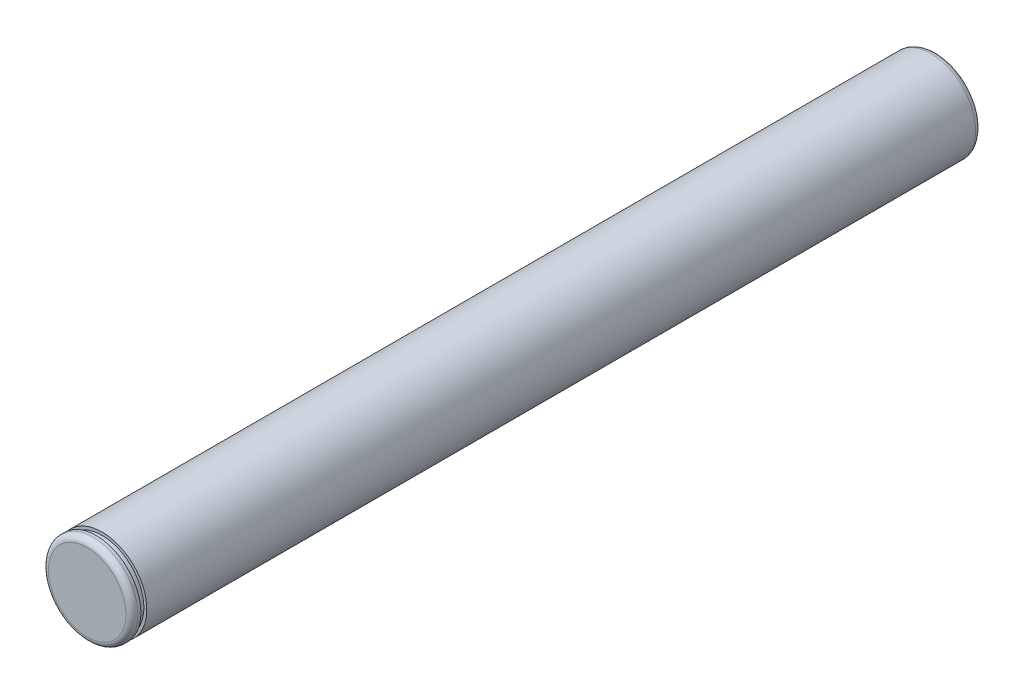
ISO-10303-21;
HEADER;
FILE_DESCRIPTION(('STEP AP214'),'2;1');
FILE_NAME('part.step','',(''),(''),'','','');
FILE_SCHEMA(('AUTOMOTIVE_DESIGN { 1 0 10303 214 1 1 1 1 }'));
ENDSEC;
DATA;
#1=APPLICATION_CONTEXT('core data for automotive mechanical design processes');
#2=APPLICATION_PROTOCOL_DEFINITION('international standard','automotive_design',2000,#1);
#3=PRODUCT_CONTEXT('',#1,'mechanical');
#4=PRODUCT('Part','Part','',(#3));
#5=PRODUCT_RELATED_PRODUCT_CATEGORY('part','',(#4));
#6=PRODUCT_DEFINITION_FORMATION('','',#4);
#7=PRODUCT_DEFINITION_CONTEXT('part definition',#1,'design');
#8=PRODUCT_DEFINITION('design','',#6,#7);
#9=PRODUCT_DEFINITION_SHAPE('','',#8);
#10=(LENGTH_UNIT() NAMED_UNIT(*) SI_UNIT(.MILLI.,.METRE.));
#11=(NAMED_UNIT(*) PLANE_ANGLE_UNIT() SI_UNIT($,.RADIAN.));
#12=(NAMED_UNIT(*) SI_UNIT($,.STERADIAN.) SOLID_ANGLE_UNIT());
#13=UNCERTAINTY_MEASURE_WITH_UNIT(LENGTH_MEASURE(1.E-05),#10,'distance_accuracy_value','');
#14=(GEOMETRIC_REPRESENTATION_CONTEXT(3) GLOBAL_UNCERTAINTY_ASSIGNED_CONTEXT((#13)) GLOBAL_UNIT_ASSIGNED_CONTEXT((#10,
#11,#12)) REPRESENTATION_CONTEXT('',''));
#15=CARTESIAN_POINT('',(0.,0.,0.));
#16=DIRECTION('',(0.,0.,1.));
#17=DIRECTION('',(1.,0.,0.));
#18=AXIS2_PLACEMENT_3D('',#15,#16,#17);
#19=CARTESIAN_POINT('',(0.,0.,34.7426406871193));
#20=DIRECTION('',(0.,0.,-1.));
#21=DIRECTION('',(-1.,0.,0.));
#22=AXIS2_PLACEMENT_3D('',#19,#20,#21);
#23=CYLINDRICAL_SURFACE('',#22,1.5);
#24=CARTESIAN_POINT('',(0.,0.,28.3));
#25=DIRECTION('',(0.,0.,1.));
#26=DIRECTION('',(1.,0.,0.));
#27=AXIS2_PLACEMENT_3D('',#24,#25,#26);
#28=CIRCLE('',#27,1.5);
#29=CARTESIAN_POINT('',(1.50000000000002,0.,28.3));
#30=VERTEX_POINT('',#29);
#31=EDGE_CURVE('E45',#30,#30,#28,.F.);
#32=ORIENTED_EDGE('',*,*,#31,.T.);
#33=EDGE_LOOP('',(#32));
#34=FACE_BOUND('',#33,.T.);
#35=CARTESIAN_POINT('',(0.,0.,28.2));
#36=DIRECTION('',(0.,0.,-1.));
#37=DIRECTION('',(-1.,0.,0.));
#38=AXIS2_PLACEMENT_3D('',#35,#36,#37);
#39=CIRCLE('',#38,1.50000000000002);
#40=CARTESIAN_POINT('',(-1.50000000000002,0.,28.2));
#41=VERTEX_POINT('',#40);
#42=EDGE_CURVE('E50',#41,#41,#39,.T.);
#43=ORIENTED_EDGE('',*,*,#42,.F.);
#44=EDGE_LOOP('',(#43));
#45=FACE_BOUND('',#44,.T.);
#46=ADVANCED_FACE('F30',(#34,#45),#23,.T.);
#47=CARTESIAN_POINT('',(0.,0.,28.5));
#48=DIRECTION('',(0.,0.,1.));
#49=DIRECTION('',(1.,0.,0.));
#50=AXIS2_PLACEMENT_3D('',#47,#48,#49);
#51=PLANE('',#50);
#52=CARTESIAN_POINT('',(0.,0.,28.5));
#53=DIRECTION('',(0.,0.,1.));
#54=DIRECTION('',(1.,0.,0.));
#55=AXIS2_PLACEMENT_3D('',#52,#53,#54);
#56=CIRCLE('',#55,1.3);
#57=CARTESIAN_POINT('',(1.30000000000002,0.,28.5));
#58=VERTEX_POINT('',#57);
#59=EDGE_CURVE('E10',#58,#58,#56,.T.);
#60=ORIENTED_EDGE('',*,*,#59,.T.);
#61=EDGE_LOOP('',(#60));
#62=FACE_BOUND('',#61,.T.);
#63=ADVANCED_FACE('F81',(#62),#51,.T.);
#64=CARTESIAN_POINT('',(0.,0.,28.3));
#65=DIRECTION('',(0.,0.,1.));
#66=DIRECTION('',(1.,0.,0.));
#67=AXIS2_PLACEMENT_3D('',#64,#65,#66);
#68=TOROIDAL_SURFACE('',#67,1.3,0.2);
#69=ORIENTED_EDGE('',*,*,#31,.F.);
#70=EDGE_LOOP('',(#69));
#71=FACE_BOUND('',#70,.T.);
#72=ORIENTED_EDGE('',*,*,#59,.F.);
#73=EDGE_LOOP('',(#72));
#74=FACE_BOUND('',#73,.T.);
#75=ADVANCED_FACE('F32',(#71,#74),#68,.T.);
#76=CARTESIAN_POINT('',(1.50000000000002,0.,28.2));
#77=DIRECTION('',(0.,0.,-1.));
#78=DIRECTION('',(-1.,0.,0.));
#79=AXIS2_PLACEMENT_3D('',#76,#77,#78);
#80=PLANE('',#79);
#81=ORIENTED_EDGE('',*,*,#42,.T.);
#82=EDGE_LOOP('',(#81));
#83=FACE_BOUND('',#82,.T.);
#84=CARTESIAN_POINT('',(0.,0.,28.2));
#85=DIRECTION('',(0.,0.,-1.));
#86=DIRECTION('',(-1.,0.,0.));
#87=AXIS2_PLACEMENT_3D('',#84,#85,#86);
#88=CIRCLE('',#87,1.40000000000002);
#89=CARTESIAN_POINT('',(-1.40000000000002,0.,28.2));
#90=VERTEX_POINT('',#89);
#91=EDGE_CURVE('E53',#90,#90,#88,.T.);
#92=ORIENTED_EDGE('',*,*,#91,.F.);
#93=EDGE_LOOP('',(#92));
#94=FACE_BOUND('',#93,.T.);
#95=ADVANCED_FACE('F77',(#83,#94),#80,.T.);
#96=CARTESIAN_POINT('',(0.,0.,24.635992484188));
#97=DIRECTION('',(0.,0.,-1.));
#98=DIRECTION('',(-1.,0.,0.));
#99=AXIS2_PLACEMENT_3D('',#96,#97,#98);
#100=CYLINDRICAL_SURFACE('',#99,1.40000000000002);
#101=ORIENTED_EDGE('',*,*,#91,.T.);
#102=EDGE_LOOP('',(#101));
#103=FACE_BOUND('',#102,.T.);
#104=CARTESIAN_POINT('',(0.,0.,28.));
#105=DIRECTION('',(0.,0.,-1.));
#106=DIRECTION('',(-1.,0.,0.));
#107=AXIS2_PLACEMENT_3D('',#104,#105,#106);
#108=CIRCLE('',#107,1.40000000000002);
#109=CARTESIAN_POINT('',(-1.40000000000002,0.,28.));
#110=VERTEX_POINT('',#109);
#111=EDGE_CURVE('E56',#110,#110,#108,.T.);
#112=ORIENTED_EDGE('',*,*,#111,.F.);
#113=EDGE_LOOP('',(#112));
#114=FACE_BOUND('',#113,.T.);
#115=ADVANCED_FACE('F68',(#103,#114),#100,.T.);
#116=CARTESIAN_POINT('',(1.50000000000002,0.,28.));
#117=DIRECTION('',(0.,0.,1.));
#118=DIRECTION('',(1.,0.,0.));
#119=AXIS2_PLACEMENT_3D('',#116,#117,#118);
#120=PLANE('',#119);
#121=ORIENTED_EDGE('',*,*,#111,.T.);
#122=EDGE_LOOP('',(#121));
#123=FACE_BOUND('',#122,.T.);
#124=CARTESIAN_POINT('',(0.,0.,28.));
#125=DIRECTION('',(0.,0.,-1.));
#126=DIRECTION('',(-1.,0.,0.));
#127=AXIS2_PLACEMENT_3D('',#124,#125,#126);
#128=CIRCLE('',#127,1.50000000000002);
#129=CARTESIAN_POINT('',(-1.50000000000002,0.,28.));
#130=VERTEX_POINT('',#129);
#131=EDGE_CURVE('E59',#130,#130,#128,.T.);
#132=ORIENTED_EDGE('',*,*,#131,.F.);
#133=EDGE_LOOP('',(#132));
#134=FACE_BOUND('',#133,.T.);
#135=ADVANCED_FACE('F65',(#123,#134),#120,.T.);
#136=CARTESIAN_POINT('',(0.,0.,0.));
#137=DIRECTION('',(0.,0.,1.));
#138=DIRECTION('',(1.,0.,0.));
#139=AXIS2_PLACEMENT_3D('',#136,#137,#138);
#140=PLANE('',#139);
#141=CARTESIAN_POINT('',(0.,0.,0.));
#142=DIRECTION('',(0.,0.,1.));
#143=DIRECTION('',(1.,0.,0.));
#144=AXIS2_PLACEMENT_3D('',#141,#142,#143);
#145=CIRCLE('',#144,1.3);
#146=CARTESIAN_POINT('',(1.30000000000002,0.,0.));
#147=VERTEX_POINT('',#146);
#148=EDGE_CURVE('E37',#147,#147,#145,.F.);
#149=ORIENTED_EDGE('',*,*,#148,.T.);
#150=EDGE_LOOP('',(#149));
#151=FACE_BOUND('',#150,.T.);
#152=ADVANCED_FACE('F67',(#151),#140,.F.);
#153=CARTESIAN_POINT('',(0.,0.,0.199999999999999));
#154=DIRECTION('',(0.,0.,1.));
#155=DIRECTION('',(1.,0.,0.));
#156=AXIS2_PLACEMENT_3D('',#153,#154,#155);
#157=TOROIDAL_SURFACE('',#156,1.3,0.2);
#158=ORIENTED_EDGE('',*,*,#148,.F.);
#159=EDGE_LOOP('',(#158));
#160=FACE_BOUND('',#159,.T.);
#161=CARTESIAN_POINT('',(0.,0.,0.199999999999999));
#162=DIRECTION('',(0.,0.,1.));
#163=DIRECTION('',(1.,0.,0.));
#164=AXIS2_PLACEMENT_3D('',#161,#162,#163);
#165=CIRCLE('',#164,1.5);
#166=CARTESIAN_POINT('',(1.50000000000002,0.,0.199999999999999));
#167=VERTEX_POINT('',#166);
#168=EDGE_CURVE('E41',#167,#167,#165,.T.);
#169=ORIENTED_EDGE('',*,*,#168,.F.);
#170=EDGE_LOOP('',(#169));
#171=FACE_BOUND('',#170,.T.);
#172=ADVANCED_FACE('F75',(#160,#171),#157,.T.);
#173=ORIENTED_EDGE('',*,*,#168,.T.);
#174=EDGE_LOOP('',(#173));
#175=FACE_BOUND('',#174,.T.);
#176=ORIENTED_EDGE('',*,*,#131,.T.);
#177=EDGE_LOOP('',(#176));
#178=FACE_BOUND('',#177,.T.);
#179=ADVANCED_FACE('F63',(#175,#178),#23,.T.);
#180=CLOSED_SHELL('',(#46,#63,#75,#95,#115,#135,#152,#172,#179));
#181=MANIFOLD_SOLID_BREP('B2',#180);
#182=ADVANCED_BREP_SHAPE_REPRESENTATION('',(#18,#181),#14);
#183=SHAPE_DEFINITION_REPRESENTATION(#9,#182);
ENDSEC;
END-ISO-10303-21;
